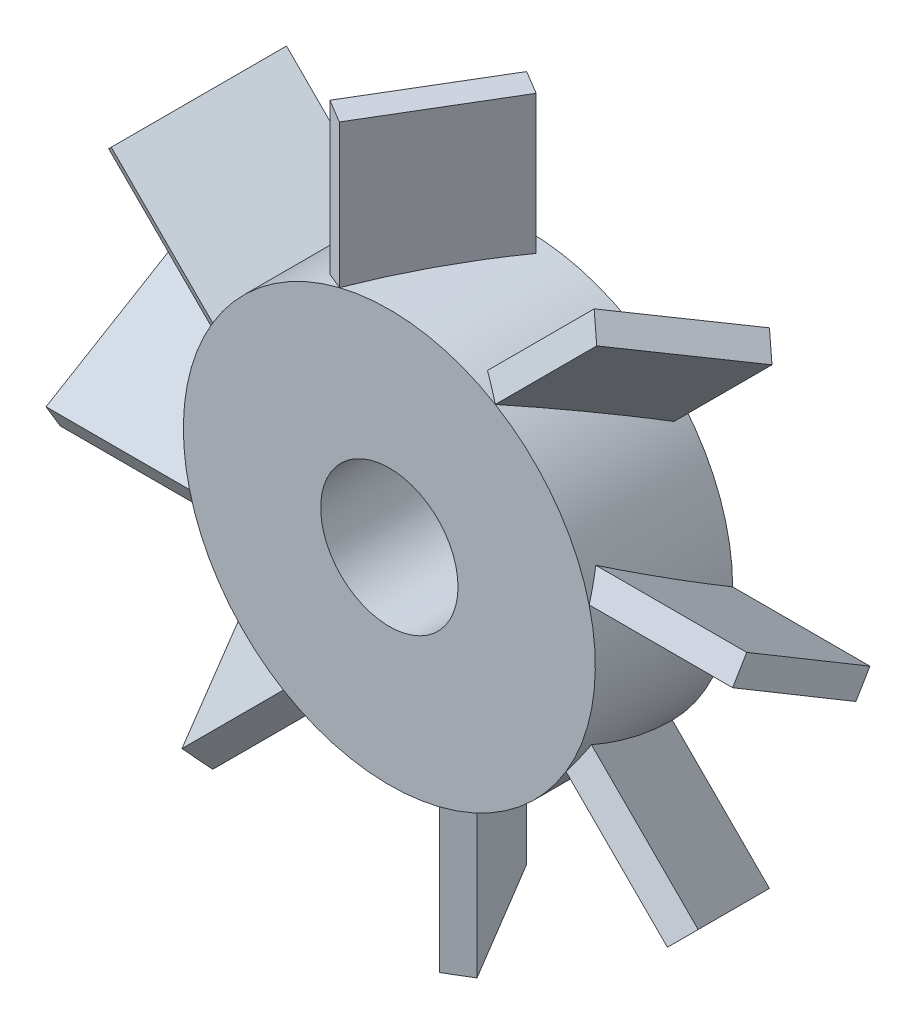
ISO-10303-21;
HEADER;
FILE_DESCRIPTION(('STEP AP214'),'2;1');
FILE_NAME('part.step','',(''),(''),'','','');
FILE_SCHEMA(('AUTOMOTIVE_DESIGN { 1 0 10303 214 1 1 1 1 }'));
ENDSEC;
DATA;
#1=APPLICATION_CONTEXT('core data for automotive mechanical design processes');
#2=APPLICATION_PROTOCOL_DEFINITION('international standard','automotive_design',2000,#1);
#3=PRODUCT_CONTEXT('',#1,'mechanical');
#4=PRODUCT('Part','Part','',(#3));
#5=PRODUCT_RELATED_PRODUCT_CATEGORY('part','',(#4));
#6=PRODUCT_DEFINITION_FORMATION('','',#4);
#7=PRODUCT_DEFINITION_CONTEXT('part definition',#1,'design');
#8=PRODUCT_DEFINITION('design','',#6,#7);
#9=PRODUCT_DEFINITION_SHAPE('','',#8);
#10=(LENGTH_UNIT() NAMED_UNIT(*) SI_UNIT(.MILLI.,.METRE.));
#11=(NAMED_UNIT(*) PLANE_ANGLE_UNIT() SI_UNIT($,.RADIAN.));
#12=(NAMED_UNIT(*) SI_UNIT($,.STERADIAN.) SOLID_ANGLE_UNIT());
#13=UNCERTAINTY_MEASURE_WITH_UNIT(LENGTH_MEASURE(1.E-05),#10,'distance_accuracy_value','');
#14=(GEOMETRIC_REPRESENTATION_CONTEXT(3) GLOBAL_UNCERTAINTY_ASSIGNED_CONTEXT((#13)) GLOBAL_UNIT_ASSIGNED_CONTEXT((#10,
#11,#12)) REPRESENTATION_CONTEXT('',''));
#15=CARTESIAN_POINT('',(0.,0.,0.));
#16=DIRECTION('',(0.,0.,1.));
#17=DIRECTION('',(1.,0.,0.));
#18=AXIS2_PLACEMENT_3D('',#15,#16,#17);
#19=CARTESIAN_POINT('',(0.,0.,5.));
#20=DIRECTION('',(0.,0.,-1.));
#21=DIRECTION('',(-1.,0.,0.));
#22=AXIS2_PLACEMENT_3D('',#19,#20,#21);
#23=CYLINDRICAL_SURFACE('',#22,7.5);
#24=CARTESIAN_POINT('',(0.,0.,0.));
#25=DIRECTION('',(0.607170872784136,-0.607170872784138,0.512530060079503));
#26=DIRECTION('',(0.362413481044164,-0.362413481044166,-0.858669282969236));
#27=AXIS2_PLACEMENT_3D('',#24,#25,#26);
#28=ELLIPSE('',#27,14.6332880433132,7.5);
#29=CARTESIAN_POINT('',(5.30330085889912,5.3033008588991,0.));
#30=VERTEX_POINT('',#29);
#31=CARTESIAN_POINT('',(3.05956077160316,6.84756072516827,4.4874699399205));
#32=VERTEX_POINT('',#31);
#33=EDGE_CURVE('E453',#30,#32,#28,.T.);
#34=ORIENTED_EDGE('',*,*,#33,.F.);
#35=CARTESIAN_POINT('',(0.,0.,0.));
#36=DIRECTION('',(0.,0.,1.));
#37=DIRECTION('',(1.,0.,0.));
#38=AXIS2_PLACEMENT_3D('',#35,#36,#37);
#39=CIRCLE('',#38,7.5);
#40=CARTESIAN_POINT('',(0.,7.5,0.));
#41=VERTEX_POINT('',#40);
#42=EDGE_CURVE('E527',#30,#41,#39,.T.);
#43=ORIENTED_EDGE('',*,*,#42,.T.);
#44=CARTESIAN_POINT('',(0.,0.,0.));
#45=DIRECTION('',(0.512530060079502,0.,-0.858669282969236));
#46=DIRECTION('',(-0.858669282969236,0.,-0.512530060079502));
#47=AXIS2_PLACEMENT_3D('',#44,#45,#46);
#48=ELLIPSE('',#47,8.73444543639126,7.5);
#49=CARTESIAN_POINT('',(0.858669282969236,7.4506836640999,0.512530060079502));
#50=VERTEX_POINT('',#49);
#51=EDGE_CURVE('E520',#41,#50,#48,.T.);
#52=ORIENTED_EDGE('',*,*,#51,.T.);
#53=CARTESIAN_POINT('',(0.,0.,1.95110507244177));
#54=DIRECTION('',(-0.858669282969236,0.,-0.512530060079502));
#55=DIRECTION('',(0.512530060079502,0.,-0.858669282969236));
#56=AXIS2_PLACEMENT_3D('',#53,#54,#55);
#57=ELLIPSE('',#56,14.6332880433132,7.5);
#58=CARTESIAN_POINT('',(-1.819851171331,7.27586020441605,5.));
#59=VERTEX_POINT('',#58);
#60=EDGE_CURVE('E522',#59,#50,#57,.T.);
#61=ORIENTED_EDGE('',*,*,#60,.F.);
#62=CARTESIAN_POINT('',(0.,0.,5.));
#63=DIRECTION('',(0.,0.,1.));
#64=DIRECTION('',(1.,0.,0.));
#65=AXIS2_PLACEMENT_3D('',#62,#63,#64);
#66=CIRCLE('',#65,7.5);
#67=CARTESIAN_POINT('',(3.85798098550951,6.43163919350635,5.));
#68=VERTEX_POINT('',#67);
#69=EDGE_CURVE('E38',#68,#59,#66,.T.);
#70=ORIENTED_EDGE('',*,*,#69,.F.);
#71=CARTESIAN_POINT('',(0.,0.,6.08624874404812));
#72=DIRECTION('',(0.362413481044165,-0.362413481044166,-0.858669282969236));
#73=DIRECTION('',(-0.607170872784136,0.607170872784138,-0.512530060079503));
#74=AXIS2_PLACEMENT_3D('',#71,#72,#73);
#75=ELLIPSE('',#74,8.73444543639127,7.5);
#76=EDGE_CURVE('E53',#32,#68,#75,.T.);
#77=ORIENTED_EDGE('',*,*,#76,.F.);
#78=EDGE_LOOP('',(#34,#43,#52,#61,#70,#77));
#79=FACE_BOUND('',#78,.T.);
#80=ADVANCED_FACE('F30',(#79),#23,.T.);
#81=CARTESIAN_POINT('',(7.5,0.,0.));
#82=VERTEX_POINT('',#81);
#83=EDGE_CURVE('E537',#82,#30,#39,.T.);
#84=ORIENTED_EDGE('',*,*,#83,.T.);
#85=CARTESIAN_POINT('',(0.,0.,0.));
#86=DIRECTION('',(0.362413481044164,-0.362413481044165,-0.858669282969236));
#87=DIRECTION('',(-0.607170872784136,0.607170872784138,-0.512530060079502));
#88=AXIS2_PLACEMENT_3D('',#85,#86,#87);
#89=ELLIPSE('',#88,8.73444543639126,7.5);
#90=CARTESIAN_POINT('',(5.87559981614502,4.66125807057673,0.512530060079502));
#91=VERTEX_POINT('',#90);
#92=EDGE_CURVE('E45',#30,#91,#89,.T.);
#93=ORIENTED_EDGE('',*,*,#92,.T.);
#94=CARTESIAN_POINT('',(0.,0.,1.95110507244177));
#95=DIRECTION('',(-0.607170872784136,0.607170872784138,-0.512530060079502));
#96=DIRECTION('',(0.362413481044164,-0.362413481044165,-0.858669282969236));
#97=AXIS2_PLACEMENT_3D('',#94,#95,#96);
#98=ELLIPSE('',#97,14.6332880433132,7.5);
#99=EDGE_CURVE('E491',#68,#91,#98,.T.);
#100=ORIENTED_EDGE('',*,*,#99,.F.);
#101=CARTESIAN_POINT('',(7.27586020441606,1.81985117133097,5.));
#102=VERTEX_POINT('',#101);
#103=EDGE_CURVE('E534',#102,#68,#66,.T.);
#104=ORIENTED_EDGE('',*,*,#103,.F.);
#105=CARTESIAN_POINT('',(0.,0.,6.08624874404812));
#106=DIRECTION('',(0.,-0.512530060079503,-0.858669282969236));
#107=DIRECTION('',(0.,0.858669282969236,-0.512530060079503));
#108=AXIS2_PLACEMENT_3D('',#105,#106,#107);
#109=ELLIPSE('',#108,8.73444543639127,7.5);
#110=CARTESIAN_POINT('',(7.0053927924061,2.67852045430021,4.4874699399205));
#111=VERTEX_POINT('',#110);
#112=EDGE_CURVE('E487',#111,#102,#109,.T.);
#113=ORIENTED_EDGE('',*,*,#112,.F.);
#114=CARTESIAN_POINT('',(0.,0.,0.));
#115=DIRECTION('',(0.,-0.858669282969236,0.512530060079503));
#116=DIRECTION('',(0.,-0.512530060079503,-0.858669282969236));
#117=AXIS2_PLACEMENT_3D('',#114,#115,#116);
#118=ELLIPSE('',#117,14.6332880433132,7.5);
#119=EDGE_CURVE('E446',#82,#111,#118,.T.);
#120=ORIENTED_EDGE('',*,*,#119,.F.);
#121=EDGE_LOOP('',(#84,#93,#100,#104,#113,#120));
#122=FACE_BOUND('',#121,.T.);
#123=ADVANCED_FACE('F604',(#122),#23,.T.);
#124=CARTESIAN_POINT('',(0.,0.,1.95110507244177));
#125=DIRECTION('',(0.60717087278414,0.607170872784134,-0.512530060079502));
#126=DIRECTION('',(-0.362413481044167,-0.362413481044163,-0.858669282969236));
#127=AXIS2_PLACEMENT_3D('',#124,#125,#126);
#128=ELLIPSE('',#127,14.6332880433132,7.5);
#129=CARTESIAN_POINT('',(6.43163919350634,-3.85798098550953,5.));
#130=VERTEX_POINT('',#129);
#131=CARTESIAN_POINT('',(4.66125807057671,-5.87559981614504,0.512530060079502));
#132=VERTEX_POINT('',#131);
#133=EDGE_CURVE('E477',#130,#132,#128,.T.);
#134=ORIENTED_EDGE('',*,*,#133,.F.);
#135=CARTESIAN_POINT('',(1.81985117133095,-7.27586020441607,5.));
#136=VERTEX_POINT('',#135);
#137=EDGE_CURVE('E585',#136,#130,#66,.T.);
#138=ORIENTED_EDGE('',*,*,#137,.F.);
#139=CARTESIAN_POINT('',(0.,0.,6.08624874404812));
#140=DIRECTION('',(-0.512530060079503,0.,-0.858669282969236));
#141=DIRECTION('',(0.858669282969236,0.,-0.512530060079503));
#142=AXIS2_PLACEMENT_3D('',#139,#140,#141);
#143=ELLIPSE('',#142,8.73444543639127,7.5);
#144=CARTESIAN_POINT('',(2.67852045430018,-7.00539279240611,4.4874699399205));
#145=VERTEX_POINT('',#144);
#146=EDGE_CURVE('E474',#145,#136,#143,.T.);
#147=ORIENTED_EDGE('',*,*,#146,.F.);
#148=CARTESIAN_POINT('',(0.,0.,0.));
#149=DIRECTION('',(-0.858669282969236,0.,0.512530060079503));
#150=DIRECTION('',(-0.512530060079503,0.,-0.858669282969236));
#151=AXIS2_PLACEMENT_3D('',#148,#149,#150);
#152=ELLIPSE('',#151,14.6332880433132,7.5);
#153=CARTESIAN_POINT('',(0.,-7.5,0.));
#154=VERTEX_POINT('',#153);
#155=EDGE_CURVE('E436',#154,#145,#152,.T.);
#156=ORIENTED_EDGE('',*,*,#155,.F.);
#157=CARTESIAN_POINT('',(5.30330085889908,-5.30330085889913,0.));
#158=VERTEX_POINT('',#157);
#159=EDGE_CURVE('E542',#154,#158,#39,.T.);
#160=ORIENTED_EDGE('',*,*,#159,.T.);
#161=CARTESIAN_POINT('',(0.,0.,0.));
#162=DIRECTION('',(-0.362413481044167,-0.362413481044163,-0.858669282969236));
#163=DIRECTION('',(0.60717087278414,0.607170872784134,-0.512530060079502));
#164=AXIS2_PLACEMENT_3D('',#161,#162,#163);
#165=ELLIPSE('',#164,8.73444543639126,7.5);
#166=EDGE_CURVE('E444',#158,#132,#165,.T.);
#167=ORIENTED_EDGE('',*,*,#166,.T.);
#168=EDGE_LOOP('',(#134,#138,#147,#156,#160,#167));
#169=FACE_BOUND('',#168,.T.);
#170=ADVANCED_FACE('F609',(#169),#23,.T.);
#171=EDGE_CURVE('E539',#158,#82,#39,.T.);
#172=ORIENTED_EDGE('',*,*,#171,.T.);
#173=CARTESIAN_POINT('',(0.,0.,0.));
#174=DIRECTION('',(0.,-0.512530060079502,-0.858669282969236));
#175=DIRECTION('',(0.,0.858669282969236,-0.512530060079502));
#176=AXIS2_PLACEMENT_3D('',#173,#174,#175);
#177=ELLIPSE('',#176,8.73444543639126,7.5);
#178=CARTESIAN_POINT('',(7.45068366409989,-0.858669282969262,0.512530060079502));
#179=VERTEX_POINT('',#178);
#180=EDGE_CURVE('E449',#82,#179,#177,.T.);
#181=ORIENTED_EDGE('',*,*,#180,.T.);
#182=CARTESIAN_POINT('',(0.,0.,1.95110507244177));
#183=DIRECTION('',(0.,0.858669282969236,-0.512530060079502));
#184=DIRECTION('',(0.,-0.512530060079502,-0.858669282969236));
#185=AXIS2_PLACEMENT_3D('',#182,#183,#184);
#186=ELLIPSE('',#185,14.6332880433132,7.5);
#187=EDGE_CURVE('E483',#102,#179,#186,.T.);
#188=ORIENTED_EDGE('',*,*,#187,.F.);
#189=EDGE_CURVE('E798',#130,#102,#66,.T.);
#190=ORIENTED_EDGE('',*,*,#189,.F.);
#191=CARTESIAN_POINT('',(0.,0.,6.08624874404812));
#192=DIRECTION('',(-0.362413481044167,-0.362413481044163,-0.858669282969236));
#193=DIRECTION('',(0.60717087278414,0.607170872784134,-0.512530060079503));
#194=AXIS2_PLACEMENT_3D('',#191,#192,#193);
#195=ELLIPSE('',#194,8.73444543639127,7.5);
#196=CARTESIAN_POINT('',(6.84756072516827,-3.05956077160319,4.4874699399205));
#197=VERTEX_POINT('',#196);
#198=EDGE_CURVE('E480',#197,#130,#195,.T.);
#199=ORIENTED_EDGE('',*,*,#198,.F.);
#200=CARTESIAN_POINT('',(0.,0.,0.));
#201=DIRECTION('',(-0.60717087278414,-0.607170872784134,0.512530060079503));
#202=DIRECTION('',(-0.362413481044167,-0.362413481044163,-0.858669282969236));
#203=AXIS2_PLACEMENT_3D('',#200,#201,#202);
#204=ELLIPSE('',#203,14.6332880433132,7.5);
#205=EDGE_CURVE('E441',#158,#197,#204,.T.);
#206=ORIENTED_EDGE('',*,*,#205,.F.);
#207=EDGE_LOOP('',(#172,#181,#188,#190,#199,#206));
#208=FACE_BOUND('',#207,.T.);
#209=ADVANCED_FACE('F797',(#208),#23,.T.);
#210=CARTESIAN_POINT('',(0.,0.,1.95110507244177));
#211=DIRECTION('',(0.858669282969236,0.,-0.512530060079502));
#212=DIRECTION('',(-0.512530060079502,0.,-0.858669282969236));
#213=AXIS2_PLACEMENT_3D('',#210,#211,#212);
#214=ELLIPSE('',#213,14.6332880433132,7.5);
#215=CARTESIAN_POINT('',(-0.858669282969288,-7.45068366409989,0.512530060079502));
#216=VERTEX_POINT('',#215);
#217=EDGE_CURVE('E471',#136,#216,#214,.T.);
#218=ORIENTED_EDGE('',*,*,#217,.F.);
#219=CARTESIAN_POINT('',(-3.85798098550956,-6.43163919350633,5.));
#220=VERTEX_POINT('',#219);
#221=EDGE_CURVE('E580',#220,#136,#66,.T.);
#222=ORIENTED_EDGE('',*,*,#221,.F.);
#223=CARTESIAN_POINT('',(0.,0.,6.08624874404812));
#224=DIRECTION('',(-0.362413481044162,0.362413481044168,-0.858669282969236));
#225=DIRECTION('',(0.607170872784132,-0.607170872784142,-0.512530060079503));
#226=AXIS2_PLACEMENT_3D('',#223,#224,#225);
#227=ELLIPSE('',#226,8.73444543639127,7.5);
#228=CARTESIAN_POINT('',(-3.05956077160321,-6.84756072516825,4.4874699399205));
#229=VERTEX_POINT('',#228);
#230=EDGE_CURVE('E468',#229,#220,#227,.T.);
#231=ORIENTED_EDGE('',*,*,#230,.F.);
#232=CARTESIAN_POINT('',(0.,0.,0.));
#233=DIRECTION('',(-0.607170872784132,0.607170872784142,0.512530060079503));
#234=DIRECTION('',(-0.362413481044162,0.362413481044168,-0.858669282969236));
#235=AXIS2_PLACEMENT_3D('',#232,#233,#234);
#236=ELLIPSE('',#235,14.6332880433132,7.5);
#237=CARTESIAN_POINT('',(-5.30330085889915,-5.30330085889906,0.));
#238=VERTEX_POINT('',#237);
#239=EDGE_CURVE('E431',#238,#229,#236,.T.);
#240=ORIENTED_EDGE('',*,*,#239,.F.);
#241=EDGE_CURVE('E547',#238,#154,#39,.T.);
#242=ORIENTED_EDGE('',*,*,#241,.T.);
#243=CARTESIAN_POINT('',(0.,0.,0.));
#244=DIRECTION('',(-0.512530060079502,0.,-0.858669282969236));
#245=DIRECTION('',(0.858669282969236,0.,-0.512530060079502));
#246=AXIS2_PLACEMENT_3D('',#243,#244,#245);
#247=ELLIPSE('',#246,8.73444543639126,7.5);
#248=EDGE_CURVE('E439',#154,#216,#247,.T.);
#249=ORIENTED_EDGE('',*,*,#248,.T.);
#250=EDGE_LOOP('',(#218,#222,#231,#240,#242,#249));
#251=FACE_BOUND('',#250,.T.);
#252=ADVANCED_FACE('F581',(#251),#23,.T.);
#253=CARTESIAN_POINT('',(0.,0.,1.95110507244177));
#254=DIRECTION('',(0.607170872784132,-0.607170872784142,-0.512530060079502));
#255=DIRECTION('',(-0.362413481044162,0.362413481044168,-0.858669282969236));
#256=AXIS2_PLACEMENT_3D('',#253,#254,#255);
#257=ELLIPSE('',#256,14.6332880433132,7.5);
#258=CARTESIAN_POINT('',(-5.87559981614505,-4.66125807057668,0.512530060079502));
#259=VERTEX_POINT('',#258);
#260=EDGE_CURVE('E465',#220,#259,#257,.T.);
#261=ORIENTED_EDGE('',*,*,#260,.F.);
#262=CARTESIAN_POINT('',(-7.27586020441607,-1.81985117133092,5.));
#263=VERTEX_POINT('',#262);
#264=EDGE_CURVE('E577',#263,#220,#66,.T.);
#265=ORIENTED_EDGE('',*,*,#264,.F.);
#266=CARTESIAN_POINT('',(0.,0.,6.08624874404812));
#267=DIRECTION('',(0.,0.512530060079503,-0.858669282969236));
#268=DIRECTION('',(0.,-0.858669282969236,-0.512530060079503));
#269=AXIS2_PLACEMENT_3D('',#266,#267,#268);
#270=ELLIPSE('',#269,8.73444543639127,7.5);
#271=CARTESIAN_POINT('',(-7.00539279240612,-2.67852045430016,4.4874699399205));
#272=VERTEX_POINT('',#271);
#273=EDGE_CURVE('E462',#272,#263,#270,.T.);
#274=ORIENTED_EDGE('',*,*,#273,.F.);
#275=CARTESIAN_POINT('',(0.,0.,0.));
#276=DIRECTION('',(0.,0.858669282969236,0.512530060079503));
#277=DIRECTION('',(0.,0.512530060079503,-0.858669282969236));
#278=AXIS2_PLACEMENT_3D('',#275,#276,#277);
#279=ELLIPSE('',#278,14.6332880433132,7.5);
#280=CARTESIAN_POINT('',(-7.5,0.,0.));
#281=VERTEX_POINT('',#280);
#282=EDGE_CURVE('E426',#281,#272,#279,.T.);
#283=ORIENTED_EDGE('',*,*,#282,.F.);
#284=EDGE_CURVE('E536',#281,#238,#39,.T.);
#285=ORIENTED_EDGE('',*,*,#284,.T.);
#286=CARTESIAN_POINT('',(0.,0.,0.));
#287=DIRECTION('',(-0.362413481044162,0.362413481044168,-0.858669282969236));
#288=DIRECTION('',(0.607170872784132,-0.607170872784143,-0.512530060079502));
#289=AXIS2_PLACEMENT_3D('',#286,#287,#288);
#290=ELLIPSE('',#289,8.73444543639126,7.5);
#291=EDGE_CURVE('E434',#238,#259,#290,.T.);
#292=ORIENTED_EDGE('',*,*,#291,.T.);
#293=EDGE_LOOP('',(#261,#265,#274,#283,#285,#292));
#294=FACE_BOUND('',#293,.T.);
#295=ADVANCED_FACE('F559',(#294),#23,.T.);
#296=CARTESIAN_POINT('',(0.,0.,1.95110507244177));
#297=DIRECTION('',(0.,-0.858669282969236,-0.512530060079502));
#298=DIRECTION('',(0.,0.512530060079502,-0.858669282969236));
#299=AXIS2_PLACEMENT_3D('',#296,#297,#298);
#300=ELLIPSE('',#299,14.6332880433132,7.5);
#301=CARTESIAN_POINT('',(-7.45068366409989,0.858669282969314,0.512530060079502));
#302=VERTEX_POINT('',#301);
#303=EDGE_CURVE('E459',#263,#302,#300,.T.);
#304=ORIENTED_EDGE('',*,*,#303,.F.);
#305=CARTESIAN_POINT('',(-6.43163919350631,3.85798098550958,5.));
#306=VERTEX_POINT('',#305);
#307=EDGE_CURVE('E37',#306,#263,#66,.T.);
#308=ORIENTED_EDGE('',*,*,#307,.F.);
#309=CARTESIAN_POINT('',(0.,0.,6.08624874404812));
#310=DIRECTION('',(0.36241348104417,0.362413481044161,-0.858669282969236));
#311=DIRECTION('',(-0.607170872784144,-0.60717087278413,-0.512530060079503));
#312=AXIS2_PLACEMENT_3D('',#309,#310,#311);
#313=ELLIPSE('',#312,8.73444543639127,7.5);
#314=CARTESIAN_POINT('',(-6.84756072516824,3.05956077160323,4.4874699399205));
#315=VERTEX_POINT('',#314);
#316=EDGE_CURVE('E456',#315,#306,#313,.T.);
#317=ORIENTED_EDGE('',*,*,#316,.F.);
#318=CARTESIAN_POINT('',(0.,0.,0.));
#319=DIRECTION('',(0.607170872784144,0.60717087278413,0.512530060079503));
#320=DIRECTION('',(0.362413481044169,0.36241348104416,-0.858669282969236));
#321=AXIS2_PLACEMENT_3D('',#318,#319,#320);
#322=ELLIPSE('',#321,14.6332880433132,7.5);
#323=CARTESIAN_POINT('',(-5.30330085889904,5.30330085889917,0.));
#324=VERTEX_POINT('',#323);
#325=EDGE_CURVE('E423',#324,#315,#322,.T.);
#326=ORIENTED_EDGE('',*,*,#325,.F.);
#327=EDGE_CURVE('E530',#324,#281,#39,.T.);
#328=ORIENTED_EDGE('',*,*,#327,.T.);
#329=CARTESIAN_POINT('',(0.,0.,0.));
#330=DIRECTION('',(0.,0.512530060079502,-0.858669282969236));
#331=DIRECTION('',(0.,-0.858669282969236,-0.512530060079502));
#332=AXIS2_PLACEMENT_3D('',#329,#330,#331);
#333=ELLIPSE('',#332,8.73444543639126,7.5);
#334=EDGE_CURVE('E429',#281,#302,#333,.T.);
#335=ORIENTED_EDGE('',*,*,#334,.T.);
#336=EDGE_LOOP('',(#304,#308,#317,#326,#328,#335));
#337=FACE_BOUND('',#336,.T.);
#338=ADVANCED_FACE('F611',(#337),#23,.T.);
#339=CARTESIAN_POINT('',(0.,0.,1.95110507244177));
#340=DIRECTION('',(-0.607170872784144,-0.60717087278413,-0.512530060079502));
#341=DIRECTION('',(0.362413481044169,0.36241348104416,-0.858669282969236));
#342=AXIS2_PLACEMENT_3D('',#339,#340,#341);
#343=ELLIPSE('',#342,14.6332880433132,7.5);
#344=CARTESIAN_POINT('',(-4.66125807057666,5.87559981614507,0.512530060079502));
#345=VERTEX_POINT('',#344);
#346=EDGE_CURVE('E250',#306,#345,#343,.T.);
#347=ORIENTED_EDGE('',*,*,#346,.F.);
#348=EDGE_CURVE('E11',#59,#306,#66,.T.);
#349=ORIENTED_EDGE('',*,*,#348,.F.);
#350=CARTESIAN_POINT('',(0.,0.,6.08624874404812));
#351=DIRECTION('',(0.512530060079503,0.,-0.858669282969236));
#352=DIRECTION('',(-0.858669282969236,0.,-0.512530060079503));
#353=AXIS2_PLACEMENT_3D('',#350,#351,#352);
#354=ELLIPSE('',#353,8.73444543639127,7.5);
#355=CARTESIAN_POINT('',(-2.67852045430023,7.0053927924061,4.4874699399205));
#356=VERTEX_POINT('',#355);
#357=EDGE_CURVE('E525',#356,#59,#354,.T.);
#358=ORIENTED_EDGE('',*,*,#357,.F.);
#359=CARTESIAN_POINT('',(0.,0.,0.));
#360=DIRECTION('',(0.858669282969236,0.,0.512530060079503));
#361=DIRECTION('',(0.512530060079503,0.,-0.858669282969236));
#362=AXIS2_PLACEMENT_3D('',#359,#360,#361);
#363=ELLIPSE('',#362,14.6332880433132,7.5);
#364=EDGE_CURVE('E517',#41,#356,#363,.T.);
#365=ORIENTED_EDGE('',*,*,#364,.F.);
#366=EDGE_CURVE('E528',#41,#324,#39,.T.);
#367=ORIENTED_EDGE('',*,*,#366,.T.);
#368=CARTESIAN_POINT('',(0.,0.,0.));
#369=DIRECTION('',(0.362413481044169,0.36241348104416,-0.858669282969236));
#370=DIRECTION('',(-0.607170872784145,-0.60717087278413,-0.512530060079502));
#371=AXIS2_PLACEMENT_3D('',#368,#369,#370);
#372=ELLIPSE('',#371,8.73444543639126,7.5);
#373=EDGE_CURVE('E451',#324,#345,#372,.T.);
#374=ORIENTED_EDGE('',*,*,#373,.T.);
#375=EDGE_LOOP('',(#347,#349,#358,#365,#367,#374));
#376=FACE_BOUND('',#375,.T.);
#377=ADVANCED_FACE('F605',(#376),#23,.T.);
#378=CARTESIAN_POINT('',(0.,0.,5.));
#379=DIRECTION('',(0.,0.,1.));
#380=DIRECTION('',(1.,0.,0.));
#381=AXIS2_PLACEMENT_3D('',#378,#379,#380);
#382=PLANE('',#381);
#383=CARTESIAN_POINT('',(0.,0.,5.));
#384=DIRECTION('',(0.,0.,1.));
#385=DIRECTION('',(1.,0.,0.));
#386=AXIS2_PLACEMENT_3D('',#383,#384,#385);
#387=CIRCLE('',#386,2.5);
#388=CARTESIAN_POINT('',(2.5,0.,5.));
#389=VERTEX_POINT('',#388);
#390=EDGE_CURVE('E688',#389,#389,#387,.T.);
#391=ORIENTED_EDGE('',*,*,#390,.F.);
#392=EDGE_LOOP('',(#391));
#393=FACE_BOUND('',#392,.T.);
#394=ORIENTED_EDGE('',*,*,#103,.T.);
#395=ORIENTED_EDGE('',*,*,#69,.T.);
#396=ORIENTED_EDGE('',*,*,#348,.T.);
#397=ORIENTED_EDGE('',*,*,#307,.T.);
#398=ORIENTED_EDGE('',*,*,#264,.T.);
#399=ORIENTED_EDGE('',*,*,#221,.T.);
#400=ORIENTED_EDGE('',*,*,#137,.T.);
#401=ORIENTED_EDGE('',*,*,#189,.T.);
#402=EDGE_LOOP('',(#394,#395,#396,#397,#398,#399,#400,#401));
#403=FACE_BOUND('',#402,.T.);
#404=ADVANCED_FACE('F586',(#393,#403),#382,.T.);
#405=CARTESIAN_POINT('',(0.,0.,0.));
#406=DIRECTION('',(0.,0.,1.));
#407=DIRECTION('',(1.,0.,0.));
#408=AXIS2_PLACEMENT_3D('',#405,#406,#407);
#409=PLANE('',#408);
#410=CARTESIAN_POINT('',(0.,0.,0.));
#411=DIRECTION('',(0.,0.,1.));
#412=DIRECTION('',(1.,0.,0.));
#413=AXIS2_PLACEMENT_3D('',#410,#411,#412);
#414=CIRCLE('',#413,2.5);
#415=CARTESIAN_POINT('',(2.5,0.,0.));
#416=VERTEX_POINT('',#415);
#417=EDGE_CURVE('E264',#416,#416,#414,.T.);
#418=ORIENTED_EDGE('',*,*,#417,.T.);
#419=EDGE_LOOP('',(#418));
#420=FACE_BOUND('',#419,.T.);
#421=ORIENTED_EDGE('',*,*,#42,.F.);
#422=ORIENTED_EDGE('',*,*,#83,.F.);
#423=ORIENTED_EDGE('',*,*,#171,.F.);
#424=ORIENTED_EDGE('',*,*,#159,.F.);
#425=ORIENTED_EDGE('',*,*,#241,.F.);
#426=ORIENTED_EDGE('',*,*,#284,.F.);
#427=ORIENTED_EDGE('',*,*,#327,.F.);
#428=ORIENTED_EDGE('',*,*,#366,.F.);
#429=EDGE_LOOP('',(#421,#422,#423,#424,#425,#426,#427,#428));
#430=FACE_BOUND('',#429,.T.);
#431=ADVANCED_FACE('F616',(#420,#430),#409,.F.);
#432=CARTESIAN_POINT('',(-2.67852045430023,12.5,4.4874699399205));
#433=DIRECTION('',(0.512530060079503,0.,-0.858669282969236));
#434=DIRECTION('',(-0.858669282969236,0.,-0.512530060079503));
#435=AXIS2_PLACEMENT_3D('',#432,#433,#434);
#436=PLANE('',#435);
#437=DIRECTION('',(0.,-1.,0.));
#438=VECTOR('',#437,1.);
#439=CARTESIAN_POINT('',(-2.67852045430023,12.5,4.4874699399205));
#440=LINE('',#439,#438);
#441=CARTESIAN_POINT('',(-2.67852045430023,12.5,4.4874699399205));
#442=VERTEX_POINT('',#441);
#443=EDGE_CURVE('E511',#442,#356,#440,.T.);
#444=ORIENTED_EDGE('',*,*,#443,.T.);
#445=ORIENTED_EDGE('',*,*,#357,.T.);
#446=DIRECTION('',(0.,-1.,0.));
#447=VECTOR('',#446,1.);
#448=CARTESIAN_POINT('',(-1.819851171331,12.5,5.));
#449=LINE('',#448,#447);
#450=CARTESIAN_POINT('',(-1.819851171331,12.5,5.));
#451=VERTEX_POINT('',#450);
#452=EDGE_CURVE('E508',#451,#59,#449,.T.);
#453=ORIENTED_EDGE('',*,*,#452,.F.);
#454=DIRECTION('',(0.858669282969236,0.,0.512530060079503));
#455=VECTOR('',#454,1.);
#456=CARTESIAN_POINT('',(-2.67852045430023,12.5,4.4874699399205));
#457=LINE('',#456,#455);
#458=EDGE_CURVE('E499',#442,#451,#457,.T.);
#459=ORIENTED_EDGE('',*,*,#458,.F.);
#460=EDGE_LOOP('',(#444,#445,#453,#459));
#461=FACE_BOUND('',#460,.T.);
#462=ADVANCED_FACE('F675',(#461),#436,.F.);
#463=CARTESIAN_POINT('',(-1.819851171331,12.5,5.));
#464=DIRECTION('',(-0.858669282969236,0.,-0.512530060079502));
#465=DIRECTION('',(-0.512530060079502,0.,0.858669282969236));
#466=AXIS2_PLACEMENT_3D('',#463,#464,#465);
#467=PLANE('',#466);
#468=ORIENTED_EDGE('',*,*,#452,.T.);
#469=ORIENTED_EDGE('',*,*,#60,.T.);
#470=DIRECTION('',(0.,-1.,0.));
#471=VECTOR('',#470,1.);
#472=CARTESIAN_POINT('',(0.858669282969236,12.5,0.512530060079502));
#473=LINE('',#472,#471);
#474=CARTESIAN_POINT('',(0.858669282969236,12.5,0.512530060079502));
#475=VERTEX_POINT('',#474);
#476=EDGE_CURVE('E505',#475,#50,#473,.T.);
#477=ORIENTED_EDGE('',*,*,#476,.F.);
#478=DIRECTION('',(0.512530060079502,0.,-0.858669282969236));
#479=VECTOR('',#478,1.);
#480=CARTESIAN_POINT('',(-1.819851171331,12.5,5.));
#481=LINE('',#480,#479);
#482=EDGE_CURVE('E496',#451,#475,#481,.T.);
#483=ORIENTED_EDGE('',*,*,#482,.F.);
#484=EDGE_LOOP('',(#468,#469,#477,#483));
#485=FACE_BOUND('',#484,.T.);
#486=ADVANCED_FACE('F638',(#485),#467,.F.);
#487=CARTESIAN_POINT('',(0.,12.5,0.));
#488=DIRECTION('',(0.512530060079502,0.,-0.858669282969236));
#489=DIRECTION('',(-0.858669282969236,0.,-0.512530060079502));
#490=AXIS2_PLACEMENT_3D('',#487,#488,#489);
#491=PLANE('',#490);
#492=ORIENTED_EDGE('',*,*,#51,.F.);
#493=DIRECTION('',(0.,-1.,0.));
#494=VECTOR('',#493,1.);
#495=CARTESIAN_POINT('',(0.,12.5,0.));
#496=LINE('',#495,#494);
#497=CARTESIAN_POINT('',(0.,12.5,0.));
#498=VERTEX_POINT('',#497);
#499=EDGE_CURVE('E514',#498,#41,#496,.T.);
#500=ORIENTED_EDGE('',*,*,#499,.F.);
#501=DIRECTION('',(0.858669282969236,0.,0.512530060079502));
#502=VECTOR('',#501,1.);
#503=CARTESIAN_POINT('',(0.,12.5,0.));
#504=LINE('',#503,#502);
#505=EDGE_CURVE('E493',#498,#475,#504,.T.);
#506=ORIENTED_EDGE('',*,*,#505,.T.);
#507=ORIENTED_EDGE('',*,*,#476,.T.);
#508=EDGE_LOOP('',(#492,#500,#506,#507));
#509=FACE_BOUND('',#508,.T.);
#510=ADVANCED_FACE('F628',(#509),#491,.T.);
#511=CARTESIAN_POINT('',(0.,12.5,0.));
#512=DIRECTION('',(0.858669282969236,0.,0.512530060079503));
#513=DIRECTION('',(0.512530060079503,0.,-0.858669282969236));
#514=AXIS2_PLACEMENT_3D('',#511,#512,#513);
#515=PLANE('',#514);
#516=ORIENTED_EDGE('',*,*,#499,.T.);
#517=ORIENTED_EDGE('',*,*,#364,.T.);
#518=ORIENTED_EDGE('',*,*,#443,.F.);
#519=DIRECTION('',(-0.512530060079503,0.,0.858669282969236));
#520=VECTOR('',#519,1.);
#521=CARTESIAN_POINT('',(0.,12.5,0.));
#522=LINE('',#521,#520);
#523=EDGE_CURVE('E502',#498,#442,#522,.T.);
#524=ORIENTED_EDGE('',*,*,#523,.F.);
#525=EDGE_LOOP('',(#516,#517,#518,#524));
#526=FACE_BOUND('',#525,.T.);
#527=ADVANCED_FACE('F632',(#526),#515,.F.);
#528=CARTESIAN_POINT('',(0.858669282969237,12.5,0.512530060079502));
#529=DIRECTION('',(0.,1.,0.));
#530=DIRECTION('',(0.,0.,1.));
#531=AXIS2_PLACEMENT_3D('',#528,#529,#530);
#532=PLANE('',#531);
#533=ORIENTED_EDGE('',*,*,#505,.F.);
#534=ORIENTED_EDGE('',*,*,#523,.T.);
#535=ORIENTED_EDGE('',*,*,#458,.T.);
#536=ORIENTED_EDGE('',*,*,#482,.T.);
#537=EDGE_LOOP('',(#533,#534,#535,#536));
#538=FACE_BOUND('',#537,.T.);
#539=ADVANCED_FACE('F635',(#538),#532,.T.);
#540=CARTESIAN_POINT('',(-8.23166389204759,9.44600563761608,0.512530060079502));
#541=DIRECTION('',(-0.707106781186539,0.707106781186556,0.));
#542=DIRECTION('',(0.,0.,1.));
#543=AXIS2_PLACEMENT_3D('',#540,#541,#542);
#544=PLANE('',#543);
#545=DIRECTION('',(0.607170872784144,0.60717087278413,0.512530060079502));
#546=VECTOR('',#545,1.);
#547=CARTESIAN_POINT('',(-8.83883476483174,8.83883476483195,0.));
#548=LINE('',#547,#546);
#549=CARTESIAN_POINT('',(-8.83883476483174,8.83883476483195,0.));
#550=VERTEX_POINT('',#549);
#551=CARTESIAN_POINT('',(-8.23166389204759,9.44600563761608,0.512530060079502));
#552=VERTEX_POINT('',#551);
#553=EDGE_CURVE('E257',#550,#552,#548,.T.);
#554=ORIENTED_EDGE('',*,*,#553,.F.);
#555=DIRECTION('',(-0.362413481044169,-0.36241348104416,0.858669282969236));
#556=VECTOR('',#555,1.);
#557=CARTESIAN_POINT('',(-8.83883476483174,8.83883476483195,0.));
#558=LINE('',#557,#556);
#559=CARTESIAN_POINT('',(-10.7328347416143,6.94483478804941,4.4874699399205));
#560=VERTEX_POINT('',#559);
#561=EDGE_CURVE('E254',#550,#560,#558,.T.);
#562=ORIENTED_EDGE('',*,*,#561,.T.);
#563=DIRECTION('',(0.607170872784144,0.60717087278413,0.512530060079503));
#564=VECTOR('',#563,1.);
#565=CARTESIAN_POINT('',(-10.7328347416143,6.94483478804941,4.4874699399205));
#566=LINE('',#565,#564);
#567=CARTESIAN_POINT('',(-10.1256638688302,7.55200566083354,5.));
#568=VERTEX_POINT('',#567);
#569=EDGE_CURVE('E268',#560,#568,#566,.T.);
#570=ORIENTED_EDGE('',*,*,#569,.T.);
#571=DIRECTION('',(0.362413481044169,0.36241348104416,-0.858669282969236));
#572=VECTOR('',#571,1.);
#573=CARTESIAN_POINT('',(-10.1256638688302,7.55200566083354,5.));
#574=LINE('',#573,#572);
#575=EDGE_CURVE('E248',#568,#552,#574,.T.);
#576=ORIENTED_EDGE('',*,*,#575,.T.);
#577=EDGE_LOOP('',(#554,#562,#570,#576));
#578=FACE_BOUND('',#577,.T.);
#579=ADVANCED_FACE('F266',(#578),#544,.T.);
#580=CARTESIAN_POINT('',(-8.83883476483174,8.83883476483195,0.));
#581=DIRECTION('',(0.607170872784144,0.60717087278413,0.512530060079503));
#582=DIRECTION('',(-0.707106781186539,0.707106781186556,0.));
#583=AXIS2_PLACEMENT_3D('',#580,#581,#582);
#584=PLANE('',#583);
#585=DIRECTION('',(0.707106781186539,-0.707106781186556,0.));
#586=VECTOR('',#585,1.);
#587=CARTESIAN_POINT('',(-8.83883476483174,8.83883476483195,0.));
#588=LINE('',#587,#586);
#589=EDGE_CURVE('E260',#550,#324,#588,.T.);
#590=ORIENTED_EDGE('',*,*,#589,.T.);
#591=ORIENTED_EDGE('',*,*,#325,.T.);
#592=DIRECTION('',(0.707106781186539,-0.707106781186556,0.));
#593=VECTOR('',#592,1.);
#594=CARTESIAN_POINT('',(-10.7328347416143,6.94483478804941,4.4874699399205));
#595=LINE('',#594,#593);
#596=EDGE_CURVE('E275',#560,#315,#595,.T.);
#597=ORIENTED_EDGE('',*,*,#596,.F.);
#598=ORIENTED_EDGE('',*,*,#561,.F.);
#599=EDGE_LOOP('',(#590,#591,#597,#598));
#600=FACE_BOUND('',#599,.T.);
#601=ADVANCED_FACE('F624',(#600),#584,.F.);
#602=CARTESIAN_POINT('',(-10.7328347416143,6.94483478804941,4.4874699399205));
#603=DIRECTION('',(0.36241348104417,0.362413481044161,-0.858669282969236));
#604=DIRECTION('',(-0.921301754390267,0.,-0.38884839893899));
#605=AXIS2_PLACEMENT_3D('',#602,#603,#604);
#606=PLANE('',#605);
#607=ORIENTED_EDGE('',*,*,#596,.T.);
#608=ORIENTED_EDGE('',*,*,#316,.T.);
#609=DIRECTION('',(0.707106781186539,-0.707106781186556,0.));
#610=VECTOR('',#609,1.);
#611=CARTESIAN_POINT('',(-10.1256638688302,7.55200566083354,5.));
#612=LINE('',#611,#610);
#613=EDGE_CURVE('E253',#568,#306,#612,.T.);
#614=ORIENTED_EDGE('',*,*,#613,.F.);
#615=ORIENTED_EDGE('',*,*,#569,.F.);
#616=EDGE_LOOP('',(#607,#608,#614,#615));
#617=FACE_BOUND('',#616,.T.);
#618=ADVANCED_FACE('F622',(#617),#606,.F.);
#619=CARTESIAN_POINT('',(-8.83883476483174,8.83883476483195,0.));
#620=DIRECTION('',(0.362413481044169,0.36241348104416,-0.858669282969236));
#621=DIRECTION('',(-0.921301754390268,0.,-0.388848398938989));
#622=AXIS2_PLACEMENT_3D('',#619,#620,#621);
#623=PLANE('',#622);
#624=ORIENTED_EDGE('',*,*,#373,.F.);
#625=ORIENTED_EDGE('',*,*,#589,.F.);
#626=ORIENTED_EDGE('',*,*,#553,.T.);
#627=DIRECTION('',(0.707106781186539,-0.707106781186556,0.));
#628=VECTOR('',#627,1.);
#629=CARTESIAN_POINT('',(-8.23166389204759,9.44600563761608,0.512530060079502));
#630=LINE('',#629,#628);
#631=EDGE_CURVE('E243',#552,#345,#630,.T.);
#632=ORIENTED_EDGE('',*,*,#631,.T.);
#633=EDGE_LOOP('',(#624,#625,#626,#632));
#634=FACE_BOUND('',#633,.T.);
#635=ADVANCED_FACE('F258',(#634),#623,.T.);
#636=CARTESIAN_POINT('',(-10.1256638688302,7.55200566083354,5.));
#637=DIRECTION('',(-0.607170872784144,-0.60717087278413,-0.512530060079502));
#638=DIRECTION('',(0.707106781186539,-0.707106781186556,0.));
#639=AXIS2_PLACEMENT_3D('',#636,#637,#638);
#640=PLANE('',#639);
#641=ORIENTED_EDGE('',*,*,#613,.T.);
#642=ORIENTED_EDGE('',*,*,#346,.T.);
#643=ORIENTED_EDGE('',*,*,#631,.F.);
#644=ORIENTED_EDGE('',*,*,#575,.F.);
#645=EDGE_LOOP('',(#641,#642,#643,#644));
#646=FACE_BOUND('',#645,.T.);
#647=ADVANCED_FACE('F246',(#646),#640,.F.);
#648=CARTESIAN_POINT('',(-12.5,0.858669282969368,0.512530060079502));
#649=DIRECTION('',(-1.,0.,0.));
#650=DIRECTION('',(0.,0.,1.));
#651=AXIS2_PLACEMENT_3D('',#648,#649,#650);
#652=PLANE('',#651);
#653=DIRECTION('',(0.,0.858669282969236,0.512530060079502));
#654=VECTOR('',#653,1.);
#655=CARTESIAN_POINT('',(-12.5,1.30930626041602E-13,0.));
#656=LINE('',#655,#654);
#657=CARTESIAN_POINT('',(-12.5,1.30930626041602E-13,0.));
#658=VERTEX_POINT('',#657);
#659=CARTESIAN_POINT('',(-12.5,0.858669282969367,0.512530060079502));
#660=VERTEX_POINT('',#659);
#661=EDGE_CURVE('E279',#658,#660,#656,.T.);
#662=ORIENTED_EDGE('',*,*,#661,.F.);
#663=DIRECTION('',(0.,-0.512530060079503,0.858669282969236));
#664=VECTOR('',#663,1.);
#665=CARTESIAN_POINT('',(-12.5,1.30930626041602E-13,0.));
#666=LINE('',#665,#664);
#667=CARTESIAN_POINT('',(-12.5,-2.6785204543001,4.4874699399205));
#668=VERTEX_POINT('',#667);
#669=EDGE_CURVE('E288',#658,#668,#666,.T.);
#670=ORIENTED_EDGE('',*,*,#669,.T.);
#671=DIRECTION('',(0.,0.858669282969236,0.512530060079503));
#672=VECTOR('',#671,1.);
#673=CARTESIAN_POINT('',(-12.5,-2.6785204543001,4.4874699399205));
#674=LINE('',#673,#672);
#675=CARTESIAN_POINT('',(-12.5,-1.81985117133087,5.));
#676=VERTEX_POINT('',#675);
#677=EDGE_CURVE('E285',#668,#676,#674,.T.);
#678=ORIENTED_EDGE('',*,*,#677,.T.);
#679=DIRECTION('',(0.,0.512530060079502,-0.858669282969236));
#680=VECTOR('',#679,1.);
#681=CARTESIAN_POINT('',(-12.5,-1.81985117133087,5.));
#682=LINE('',#681,#680);
#683=EDGE_CURVE('E282',#676,#660,#682,.T.);
#684=ORIENTED_EDGE('',*,*,#683,.T.);
#685=EDGE_LOOP('',(#662,#670,#678,#684));
#686=FACE_BOUND('',#685,.T.);
#687=ADVANCED_FACE('F706',(#686),#652,.T.);
#688=CARTESIAN_POINT('',(-12.5,-1.81985117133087,5.));
#689=DIRECTION('',(0.,-0.858669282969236,-0.512530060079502));
#690=DIRECTION('',(0.,0.512530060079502,-0.858669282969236));
#691=AXIS2_PLACEMENT_3D('',#688,#689,#690);
#692=PLANE('',#691);
#693=DIRECTION('',(1.,0.,0.));
#694=VECTOR('',#693,1.);
#695=CARTESIAN_POINT('',(-12.5,-1.81985117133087,5.));
#696=LINE('',#695,#694);
#697=EDGE_CURVE('E294',#676,#263,#696,.T.);
#698=ORIENTED_EDGE('',*,*,#697,.T.);
#699=ORIENTED_EDGE('',*,*,#303,.T.);
#700=DIRECTION('',(1.,0.,0.));
#701=VECTOR('',#700,1.);
#702=CARTESIAN_POINT('',(-12.5,0.858669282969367,0.512530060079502));
#703=LINE('',#702,#701);
#704=EDGE_CURVE('E291',#660,#302,#703,.T.);
#705=ORIENTED_EDGE('',*,*,#704,.F.);
#706=ORIENTED_EDGE('',*,*,#683,.F.);
#707=EDGE_LOOP('',(#698,#699,#705,#706));
#708=FACE_BOUND('',#707,.T.);
#709=ADVANCED_FACE('F713',(#708),#692,.F.);
#710=CARTESIAN_POINT('',(-12.5,1.30930626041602E-13,0.));
#711=DIRECTION('',(0.,0.858669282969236,0.512530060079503));
#712=DIRECTION('',(0.,-0.512530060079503,0.858669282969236));
#713=AXIS2_PLACEMENT_3D('',#710,#711,#712);
#714=PLANE('',#713);
#715=DIRECTION('',(1.,0.,0.));
#716=VECTOR('',#715,1.);
#717=CARTESIAN_POINT('',(-12.5,1.30930626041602E-13,0.));
#718=LINE('',#717,#716);
#719=EDGE_CURVE('E300',#658,#281,#718,.T.);
#720=ORIENTED_EDGE('',*,*,#719,.T.);
#721=ORIENTED_EDGE('',*,*,#282,.T.);
#722=DIRECTION('',(1.,0.,0.));
#723=VECTOR('',#722,1.);
#724=CARTESIAN_POINT('',(-12.5,-2.6785204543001,4.4874699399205));
#725=LINE('',#724,#723);
#726=EDGE_CURVE('E297',#668,#272,#725,.T.);
#727=ORIENTED_EDGE('',*,*,#726,.F.);
#728=ORIENTED_EDGE('',*,*,#669,.F.);
#729=EDGE_LOOP('',(#720,#721,#727,#728));
#730=FACE_BOUND('',#729,.T.);
#731=ADVANCED_FACE('F719',(#730),#714,.F.);
#732=CARTESIAN_POINT('',(-12.5,1.30930626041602E-13,0.));
#733=DIRECTION('',(0.,0.512530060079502,-0.858669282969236));
#734=DIRECTION('',(0.,0.858669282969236,0.512530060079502));
#735=AXIS2_PLACEMENT_3D('',#732,#733,#734);
#736=PLANE('',#735);
#737=ORIENTED_EDGE('',*,*,#334,.F.);
#738=ORIENTED_EDGE('',*,*,#719,.F.);
#739=ORIENTED_EDGE('',*,*,#661,.T.);
#740=ORIENTED_EDGE('',*,*,#704,.T.);
#741=EDGE_LOOP('',(#737,#738,#739,#740));
#742=FACE_BOUND('',#741,.T.);
#743=ADVANCED_FACE('F715',(#742),#736,.T.);
#744=CARTESIAN_POINT('',(-12.5,-2.6785204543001,4.4874699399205));
#745=DIRECTION('',(0.,0.512530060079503,-0.858669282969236));
#746=DIRECTION('',(0.,0.858669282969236,0.512530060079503));
#747=AXIS2_PLACEMENT_3D('',#744,#745,#746);
#748=PLANE('',#747);
#749=ORIENTED_EDGE('',*,*,#726,.T.);
#750=ORIENTED_EDGE('',*,*,#273,.T.);
#751=ORIENTED_EDGE('',*,*,#697,.F.);
#752=ORIENTED_EDGE('',*,*,#677,.F.);
#753=EDGE_LOOP('',(#749,#750,#751,#752));
#754=FACE_BOUND('',#753,.T.);
#755=ADVANCED_FACE('F718',(#754),#748,.F.);
#756=CARTESIAN_POINT('',(-9.44600563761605,-8.23166389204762,0.512530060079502));
#757=DIRECTION('',(-0.707106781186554,-0.707106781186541,0.));
#758=DIRECTION('',(0.,0.,1.));
#759=AXIS2_PLACEMENT_3D('',#756,#757,#758);
#760=PLANE('',#759);
#761=DIRECTION('',(-0.607170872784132,0.607170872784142,0.512530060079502));
#762=VECTOR('',#761,1.);
#763=CARTESIAN_POINT('',(-8.83883476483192,-8.83883476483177,0.));
#764=LINE('',#763,#762);
#765=CARTESIAN_POINT('',(-8.83883476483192,-8.83883476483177,0.));
#766=VERTEX_POINT('',#765);
#767=CARTESIAN_POINT('',(-9.44600563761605,-8.23166389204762,0.512530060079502));
#768=VERTEX_POINT('',#767);
#769=EDGE_CURVE('E303',#766,#768,#764,.T.);
#770=ORIENTED_EDGE('',*,*,#769,.F.);
#771=DIRECTION('',(0.362413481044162,-0.362413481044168,0.858669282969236));
#772=VECTOR('',#771,1.);
#773=CARTESIAN_POINT('',(-8.83883476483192,-8.83883476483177,0.));
#774=LINE('',#773,#772);
#775=CARTESIAN_POINT('',(-6.94483478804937,-10.7328347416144,4.4874699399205));
#776=VERTEX_POINT('',#775);
#777=EDGE_CURVE('E312',#766,#776,#774,.T.);
#778=ORIENTED_EDGE('',*,*,#777,.T.);
#779=DIRECTION('',(-0.607170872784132,0.607170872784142,0.512530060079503));
#780=VECTOR('',#779,1.);
#781=CARTESIAN_POINT('',(-6.94483478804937,-10.7328347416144,4.4874699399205));
#782=LINE('',#781,#780);
#783=CARTESIAN_POINT('',(-7.5520056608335,-10.1256638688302,5.));
#784=VERTEX_POINT('',#783);
#785=EDGE_CURVE('E309',#776,#784,#782,.T.);
#786=ORIENTED_EDGE('',*,*,#785,.T.);
#787=DIRECTION('',(-0.362413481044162,0.362413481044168,-0.858669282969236));
#788=VECTOR('',#787,1.);
#789=CARTESIAN_POINT('',(-7.5520056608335,-10.1256638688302,5.));
#790=LINE('',#789,#788);
#791=EDGE_CURVE('E306',#784,#768,#790,.T.);
#792=ORIENTED_EDGE('',*,*,#791,.T.);
#793=EDGE_LOOP('',(#770,#778,#786,#792));
#794=FACE_BOUND('',#793,.T.);
#795=ADVANCED_FACE('F570',(#794),#760,.T.);
#796=CARTESIAN_POINT('',(-7.5520056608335,-10.1256638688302,5.));
#797=DIRECTION('',(0.607170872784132,-0.607170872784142,-0.512530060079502));
#798=DIRECTION('',(0.707106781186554,0.707106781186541,0.));
#799=AXIS2_PLACEMENT_3D('',#796,#797,#798);
#800=PLANE('',#799);
#801=DIRECTION('',(0.707106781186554,0.707106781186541,0.));
#802=VECTOR('',#801,1.);
#803=CARTESIAN_POINT('',(-7.5520056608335,-10.1256638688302,5.));
#804=LINE('',#803,#802);
#805=EDGE_CURVE('E318',#784,#220,#804,.T.);
#806=ORIENTED_EDGE('',*,*,#805,.T.);
#807=ORIENTED_EDGE('',*,*,#260,.T.);
#808=DIRECTION('',(0.707106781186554,0.707106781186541,0.));
#809=VECTOR('',#808,1.);
#810=CARTESIAN_POINT('',(-9.44600563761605,-8.23166389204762,0.512530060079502));
#811=LINE('',#810,#809);
#812=EDGE_CURVE('E315',#768,#259,#811,.T.);
#813=ORIENTED_EDGE('',*,*,#812,.F.);
#814=ORIENTED_EDGE('',*,*,#791,.F.);
#815=EDGE_LOOP('',(#806,#807,#813,#814));
#816=FACE_BOUND('',#815,.T.);
#817=ADVANCED_FACE('F573',(#816),#800,.F.);
#818=CARTESIAN_POINT('',(-8.83883476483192,-8.83883476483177,0.));
#819=DIRECTION('',(-0.607170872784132,0.607170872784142,0.512530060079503));
#820=DIRECTION('',(-0.707106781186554,-0.707106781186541,0.));
#821=AXIS2_PLACEMENT_3D('',#818,#819,#820);
#822=PLANE('',#821);
#823=DIRECTION('',(0.707106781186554,0.707106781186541,0.));
#824=VECTOR('',#823,1.);
#825=CARTESIAN_POINT('',(-8.83883476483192,-8.83883476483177,0.));
#826=LINE('',#825,#824);
#827=EDGE_CURVE('E324',#766,#238,#826,.T.);
#828=ORIENTED_EDGE('',*,*,#827,.T.);
#829=ORIENTED_EDGE('',*,*,#239,.T.);
#830=DIRECTION('',(0.707106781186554,0.707106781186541,0.));
#831=VECTOR('',#830,1.);
#832=CARTESIAN_POINT('',(-6.94483478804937,-10.7328347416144,4.4874699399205));
#833=LINE('',#832,#831);
#834=EDGE_CURVE('E321',#776,#229,#833,.T.);
#835=ORIENTED_EDGE('',*,*,#834,.F.);
#836=ORIENTED_EDGE('',*,*,#777,.F.);
#837=EDGE_LOOP('',(#828,#829,#835,#836));
#838=FACE_BOUND('',#837,.T.);
#839=ADVANCED_FACE('F567',(#838),#822,.F.);
#840=CARTESIAN_POINT('',(-8.83883476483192,-8.83883476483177,0.));
#841=DIRECTION('',(-0.362413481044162,0.362413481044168,-0.858669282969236));
#842=DIRECTION('',(0.,0.921301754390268,0.388848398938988));
#843=AXIS2_PLACEMENT_3D('',#840,#841,#842);
#844=PLANE('',#843);
#845=ORIENTED_EDGE('',*,*,#291,.F.);
#846=ORIENTED_EDGE('',*,*,#827,.F.);
#847=ORIENTED_EDGE('',*,*,#769,.T.);
#848=ORIENTED_EDGE('',*,*,#812,.T.);
#849=EDGE_LOOP('',(#845,#846,#847,#848));
#850=FACE_BOUND('',#849,.T.);
#851=ADVANCED_FACE('F563',(#850),#844,.T.);
#852=CARTESIAN_POINT('',(-6.94483478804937,-10.7328347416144,4.4874699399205));
#853=DIRECTION('',(-0.362413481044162,0.362413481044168,-0.858669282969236));
#854=DIRECTION('',(0.,0.921301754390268,0.388848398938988));
#855=AXIS2_PLACEMENT_3D('',#852,#853,#854);
#856=PLANE('',#855);
#857=ORIENTED_EDGE('',*,*,#834,.T.);
#858=ORIENTED_EDGE('',*,*,#230,.T.);
#859=ORIENTED_EDGE('',*,*,#805,.F.);
#860=ORIENTED_EDGE('',*,*,#785,.F.);
#861=EDGE_LOOP('',(#857,#858,#859,#860));
#862=FACE_BOUND('',#861,.T.);
#863=ADVANCED_FACE('F589',(#862),#856,.F.);
#864=CARTESIAN_POINT('',(-0.858669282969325,-12.5,0.512530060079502));
#865=DIRECTION('',(0.,-1.,0.));
#866=DIRECTION('',(0.,0.,1.));
#867=AXIS2_PLACEMENT_3D('',#864,#865,#866);
#868=PLANE('',#867);
#869=DIRECTION('',(-0.858669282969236,0.,0.512530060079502));
#870=VECTOR('',#869,1.);
#871=CARTESIAN_POINT('',(0.,-12.5,0.));
#872=LINE('',#871,#870);
#873=CARTESIAN_POINT('',(0.,-12.5,0.));
#874=VERTEX_POINT('',#873);
#875=CARTESIAN_POINT('',(-0.858669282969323,-12.5,0.512530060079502));
#876=VERTEX_POINT('',#875);
#877=EDGE_CURVE('E327',#874,#876,#872,.T.);
#878=ORIENTED_EDGE('',*,*,#877,.F.);
#879=DIRECTION('',(0.512530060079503,0.,0.858669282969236));
#880=VECTOR('',#879,1.);
#881=CARTESIAN_POINT('',(0.,-12.5,0.));
#882=LINE('',#881,#880);
#883=CARTESIAN_POINT('',(2.67852045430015,-12.5,4.4874699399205));
#884=VERTEX_POINT('',#883);
#885=EDGE_CURVE('E336',#874,#884,#882,.T.);
#886=ORIENTED_EDGE('',*,*,#885,.T.);
#887=DIRECTION('',(-0.858669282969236,0.,0.512530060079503));
#888=VECTOR('',#887,1.);
#889=CARTESIAN_POINT('',(2.67852045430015,-12.5,4.4874699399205));
#890=LINE('',#889,#888);
#891=CARTESIAN_POINT('',(1.81985117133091,-12.5,5.));
#892=VERTEX_POINT('',#891);
#893=EDGE_CURVE('E333',#884,#892,#890,.T.);
#894=ORIENTED_EDGE('',*,*,#893,.T.);
#895=DIRECTION('',(-0.512530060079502,0.,-0.858669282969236));
#896=VECTOR('',#895,1.);
#897=CARTESIAN_POINT('',(1.81985117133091,-12.5,5.));
#898=LINE('',#897,#896);
#899=EDGE_CURVE('E330',#892,#876,#898,.T.);
#900=ORIENTED_EDGE('',*,*,#899,.T.);
#901=EDGE_LOOP('',(#878,#886,#894,#900));
#902=FACE_BOUND('',#901,.T.);
#903=ADVANCED_FACE('F591',(#902),#868,.T.);
#904=CARTESIAN_POINT('',(1.81985117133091,-12.5,5.));
#905=DIRECTION('',(0.858669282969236,0.,-0.512530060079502));
#906=DIRECTION('',(-0.512530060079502,0.,-0.858669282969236));
#907=AXIS2_PLACEMENT_3D('',#904,#905,#906);
#908=PLANE('',#907);
#909=DIRECTION('',(0.,1.,0.));
#910=VECTOR('',#909,1.);
#911=CARTESIAN_POINT('',(1.81985117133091,-12.5,5.));
#912=LINE('',#911,#910);
#913=EDGE_CURVE('E342',#892,#136,#912,.T.);
#914=ORIENTED_EDGE('',*,*,#913,.T.);
#915=ORIENTED_EDGE('',*,*,#217,.T.);
#916=DIRECTION('',(0.,1.,0.));
#917=VECTOR('',#916,1.);
#918=CARTESIAN_POINT('',(-0.858669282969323,-12.5,0.512530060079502));
#919=LINE('',#918,#917);
#920=EDGE_CURVE('E339',#876,#216,#919,.T.);
#921=ORIENTED_EDGE('',*,*,#920,.F.);
#922=ORIENTED_EDGE('',*,*,#899,.F.);
#923=EDGE_LOOP('',(#914,#915,#921,#922));
#924=FACE_BOUND('',#923,.T.);
#925=ADVANCED_FACE('F597',(#924),#908,.F.);
#926=CARTESIAN_POINT('',(0.,-12.5,0.));
#927=DIRECTION('',(-0.858669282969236,0.,0.512530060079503));
#928=DIRECTION('',(0.512530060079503,0.,0.858669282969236));
#929=AXIS2_PLACEMENT_3D('',#926,#927,#928);
#930=PLANE('',#929);
#931=DIRECTION('',(0.,1.,0.));
#932=VECTOR('',#931,1.);
#933=CARTESIAN_POINT('',(0.,-12.5,0.));
#934=LINE('',#933,#932);
#935=EDGE_CURVE('E348',#874,#154,#934,.T.);
#936=ORIENTED_EDGE('',*,*,#935,.T.);
#937=ORIENTED_EDGE('',*,*,#155,.T.);
#938=DIRECTION('',(0.,1.,0.));
#939=VECTOR('',#938,1.);
#940=CARTESIAN_POINT('',(2.67852045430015,-12.5,4.4874699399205));
#941=LINE('',#940,#939);
#942=EDGE_CURVE('E345',#884,#145,#941,.T.);
#943=ORIENTED_EDGE('',*,*,#942,.F.);
#944=ORIENTED_EDGE('',*,*,#885,.F.);
#945=EDGE_LOOP('',(#936,#937,#943,#944));
#946=FACE_BOUND('',#945,.T.);
#947=ADVANCED_FACE('F742',(#946),#930,.F.);
#948=CARTESIAN_POINT('',(0.,-12.5,0.));
#949=DIRECTION('',(-0.512530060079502,0.,-0.858669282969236));
#950=DIRECTION('',(-0.858669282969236,0.,0.512530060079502));
#951=AXIS2_PLACEMENT_3D('',#948,#949,#950);
#952=PLANE('',#951);
#953=ORIENTED_EDGE('',*,*,#248,.F.);
#954=ORIENTED_EDGE('',*,*,#935,.F.);
#955=ORIENTED_EDGE('',*,*,#877,.T.);
#956=ORIENTED_EDGE('',*,*,#920,.T.);
#957=EDGE_LOOP('',(#953,#954,#955,#956));
#958=FACE_BOUND('',#957,.T.);
#959=ADVANCED_FACE('F738',(#958),#952,.T.);
#960=CARTESIAN_POINT('',(2.67852045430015,-12.5,4.4874699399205));
#961=DIRECTION('',(-0.512530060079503,0.,-0.858669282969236));
#962=DIRECTION('',(-0.858669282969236,0.,0.512530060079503));
#963=AXIS2_PLACEMENT_3D('',#960,#961,#962);
#964=PLANE('',#963);
#965=ORIENTED_EDGE('',*,*,#942,.T.);
#966=ORIENTED_EDGE('',*,*,#146,.T.);
#967=ORIENTED_EDGE('',*,*,#913,.F.);
#968=ORIENTED_EDGE('',*,*,#893,.F.);
#969=EDGE_LOOP('',(#965,#966,#967,#968));
#970=FACE_BOUND('',#969,.T.);
#971=ADVANCED_FACE('F741',(#970),#964,.F.);
#972=CARTESIAN_POINT('',(8.23166389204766,-9.44600563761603,0.512530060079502));
#973=DIRECTION('',(0.707106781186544,-0.707106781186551,0.));
#974=DIRECTION('',(0.,0.,1.));
#975=AXIS2_PLACEMENT_3D('',#972,#973,#974);
#976=PLANE('',#975);
#977=DIRECTION('',(-0.60717087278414,-0.607170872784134,0.512530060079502));
#978=VECTOR('',#977,1.);
#979=CARTESIAN_POINT('',(8.8388347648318,-8.83883476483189,0.));
#980=LINE('',#979,#978);
#981=CARTESIAN_POINT('',(8.8388347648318,-8.83883476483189,0.));
#982=VERTEX_POINT('',#981);
#983=CARTESIAN_POINT('',(8.23166389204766,-9.44600563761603,0.512530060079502));
#984=VERTEX_POINT('',#983);
#985=EDGE_CURVE('E351',#982,#984,#980,.T.);
#986=ORIENTED_EDGE('',*,*,#985,.F.);
#987=DIRECTION('',(0.362413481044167,0.362413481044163,0.858669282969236));
#988=VECTOR('',#987,1.);
#989=CARTESIAN_POINT('',(8.8388347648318,-8.83883476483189,0.));
#990=LINE('',#989,#988);
#991=CARTESIAN_POINT('',(10.7328347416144,-6.94483478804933,4.4874699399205));
#992=VERTEX_POINT('',#991);
#993=EDGE_CURVE('E360',#982,#992,#990,.T.);
#994=ORIENTED_EDGE('',*,*,#993,.T.);
#995=DIRECTION('',(-0.60717087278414,-0.607170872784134,0.512530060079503));
#996=VECTOR('',#995,1.);
#997=CARTESIAN_POINT('',(10.7328347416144,-6.94483478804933,4.4874699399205));
#998=LINE('',#997,#996);
#999=CARTESIAN_POINT('',(10.1256638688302,-7.55200566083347,5.));
#1000=VERTEX_POINT('',#999);
#1001=EDGE_CURVE('E357',#992,#1000,#998,.T.);
#1002=ORIENTED_EDGE('',*,*,#1001,.T.);
#1003=DIRECTION('',(-0.362413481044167,-0.362413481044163,-0.858669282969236));
#1004=VECTOR('',#1003,1.);
#1005=CARTESIAN_POINT('',(10.1256638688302,-7.55200566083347,5.));
#1006=LINE('',#1005,#1004);
#1007=EDGE_CURVE('E354',#1000,#984,#1006,.T.);
#1008=ORIENTED_EDGE('',*,*,#1007,.T.);
#1009=EDGE_LOOP('',(#986,#994,#1002,#1008));
#1010=FACE_BOUND('',#1009,.T.);
#1011=ADVANCED_FACE('F749',(#1010),#976,.T.);
#1012=CARTESIAN_POINT('',(10.1256638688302,-7.55200566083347,5.));
#1013=DIRECTION('',(0.60717087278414,0.607170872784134,-0.512530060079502));
#1014=DIRECTION('',(-0.707106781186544,0.707106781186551,0.));
#1015=AXIS2_PLACEMENT_3D('',#1012,#1013,#1014);
#1016=PLANE('',#1015);
#1017=DIRECTION('',(-0.707106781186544,0.707106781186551,0.));
#1018=VECTOR('',#1017,1.);
#1019=CARTESIAN_POINT('',(10.1256638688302,-7.55200566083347,5.));
#1020=LINE('',#1019,#1018);
#1021=EDGE_CURVE('E366',#1000,#130,#1020,.T.);
#1022=ORIENTED_EDGE('',*,*,#1021,.T.);
#1023=ORIENTED_EDGE('',*,*,#133,.T.);
#1024=DIRECTION('',(-0.707106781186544,0.707106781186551,0.));
#1025=VECTOR('',#1024,1.);
#1026=CARTESIAN_POINT('',(8.23166389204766,-9.44600563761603,0.512530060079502));
#1027=LINE('',#1026,#1025);
#1028=EDGE_CURVE('E363',#984,#132,#1027,.T.);
#1029=ORIENTED_EDGE('',*,*,#1028,.F.);
#1030=ORIENTED_EDGE('',*,*,#1007,.F.);
#1031=EDGE_LOOP('',(#1022,#1023,#1029,#1030));
#1032=FACE_BOUND('',#1031,.T.);
#1033=ADVANCED_FACE('F756',(#1032),#1016,.F.);
#1034=CARTESIAN_POINT('',(8.8388347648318,-8.83883476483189,0.));
#1035=DIRECTION('',(-0.60717087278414,-0.607170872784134,0.512530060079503));
#1036=DIRECTION('',(0.707106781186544,-0.707106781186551,0.));
#1037=AXIS2_PLACEMENT_3D('',#1034,#1035,#1036);
#1038=PLANE('',#1037);
#1039=DIRECTION('',(-0.707106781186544,0.707106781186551,0.));
#1040=VECTOR('',#1039,1.);
#1041=CARTESIAN_POINT('',(8.8388347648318,-8.83883476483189,0.));
#1042=LINE('',#1041,#1040);
#1043=EDGE_CURVE('E372',#982,#158,#1042,.T.);
#1044=ORIENTED_EDGE('',*,*,#1043,.T.);
#1045=ORIENTED_EDGE('',*,*,#205,.T.);
#1046=DIRECTION('',(-0.707106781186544,0.707106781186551,0.));
#1047=VECTOR('',#1046,1.);
#1048=CARTESIAN_POINT('',(10.7328347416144,-6.94483478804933,4.4874699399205));
#1049=LINE('',#1048,#1047);
#1050=EDGE_CURVE('E369',#992,#197,#1049,.T.);
#1051=ORIENTED_EDGE('',*,*,#1050,.F.);
#1052=ORIENTED_EDGE('',*,*,#993,.F.);
#1053=EDGE_LOOP('',(#1044,#1045,#1051,#1052));
#1054=FACE_BOUND('',#1053,.T.);
#1055=ADVANCED_FACE('F762',(#1054),#1038,.F.);
#1056=CARTESIAN_POINT('',(8.8388347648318,-8.83883476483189,0.));
#1057=DIRECTION('',(-0.362413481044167,-0.362413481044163,-0.858669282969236));
#1058=DIRECTION('',(-0.921301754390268,0.,0.388848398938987));
#1059=AXIS2_PLACEMENT_3D('',#1056,#1057,#1058);
#1060=PLANE('',#1059);
#1061=ORIENTED_EDGE('',*,*,#166,.F.);
#1062=ORIENTED_EDGE('',*,*,#1043,.F.);
#1063=ORIENTED_EDGE('',*,*,#985,.T.);
#1064=ORIENTED_EDGE('',*,*,#1028,.T.);
#1065=EDGE_LOOP('',(#1061,#1062,#1063,#1064));
#1066=FACE_BOUND('',#1065,.T.);
#1067=ADVANCED_FACE('F758',(#1066),#1060,.T.);
#1068=CARTESIAN_POINT('',(10.7328347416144,-6.94483478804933,4.4874699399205));
#1069=DIRECTION('',(-0.362413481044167,-0.362413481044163,-0.858669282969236));
#1070=DIRECTION('',(-0.921301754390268,0.,0.388848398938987));
#1071=AXIS2_PLACEMENT_3D('',#1068,#1069,#1070);
#1072=PLANE('',#1071);
#1073=ORIENTED_EDGE('',*,*,#1050,.T.);
#1074=ORIENTED_EDGE('',*,*,#198,.T.);
#1075=ORIENTED_EDGE('',*,*,#1021,.F.);
#1076=ORIENTED_EDGE('',*,*,#1001,.F.);
#1077=EDGE_LOOP('',(#1073,#1074,#1075,#1076));
#1078=FACE_BOUND('',#1077,.T.);
#1079=ADVANCED_FACE('F761',(#1078),#1072,.F.);
#1080=CARTESIAN_POINT('',(12.5,-0.858669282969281,0.512530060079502));
#1081=DIRECTION('',(1.,0.,0.));
#1082=DIRECTION('',(0.,0.,1.));
#1083=AXIS2_PLACEMENT_3D('',#1080,#1081,#1082);
#1084=PLANE('',#1083);
#1085=DIRECTION('',(0.,-0.858669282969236,0.512530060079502));
#1086=VECTOR('',#1085,1.);
#1087=CARTESIAN_POINT('',(12.5,0.,0.));
#1088=LINE('',#1087,#1086);
#1089=CARTESIAN_POINT('',(12.5,0.,0.));
#1090=VERTEX_POINT('',#1089);
#1091=CARTESIAN_POINT('',(12.5,-0.85866928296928,0.512530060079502));
#1092=VERTEX_POINT('',#1091);
#1093=EDGE_CURVE('E375',#1090,#1092,#1088,.T.);
#1094=ORIENTED_EDGE('',*,*,#1093,.F.);
#1095=DIRECTION('',(0.,0.512530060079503,0.858669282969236));
#1096=VECTOR('',#1095,1.);
#1097=CARTESIAN_POINT('',(12.5,0.,0.));
#1098=LINE('',#1097,#1096);
#1099=CARTESIAN_POINT('',(12.5,2.67852045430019,4.4874699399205));
#1100=VERTEX_POINT('',#1099);
#1101=EDGE_CURVE('E384',#1090,#1100,#1098,.T.);
#1102=ORIENTED_EDGE('',*,*,#1101,.T.);
#1103=DIRECTION('',(0.,-0.858669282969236,0.512530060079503));
#1104=VECTOR('',#1103,1.);
#1105=CARTESIAN_POINT('',(12.5,2.67852045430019,4.4874699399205));
#1106=LINE('',#1105,#1104);
#1107=CARTESIAN_POINT('',(12.5,1.81985117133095,5.));
#1108=VERTEX_POINT('',#1107);
#1109=EDGE_CURVE('E381',#1100,#1108,#1106,.T.);
#1110=ORIENTED_EDGE('',*,*,#1109,.T.);
#1111=DIRECTION('',(0.,-0.512530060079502,-0.858669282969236));
#1112=VECTOR('',#1111,1.);
#1113=CARTESIAN_POINT('',(12.5,1.81985117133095,5.));
#1114=LINE('',#1113,#1112);
#1115=EDGE_CURVE('E378',#1108,#1092,#1114,.T.);
#1116=ORIENTED_EDGE('',*,*,#1115,.T.);
#1117=EDGE_LOOP('',(#1094,#1102,#1110,#1116));
#1118=FACE_BOUND('',#1117,.T.);
#1119=ADVANCED_FACE('F769',(#1118),#1084,.T.);
#1120=CARTESIAN_POINT('',(12.5,1.81985117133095,5.));
#1121=DIRECTION('',(0.,0.858669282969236,-0.512530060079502));
#1122=DIRECTION('',(0.,0.512530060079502,0.858669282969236));
#1123=AXIS2_PLACEMENT_3D('',#1120,#1121,#1122);
#1124=PLANE('',#1123);
#1125=DIRECTION('',(-1.,0.,0.));
#1126=VECTOR('',#1125,1.);
#1127=CARTESIAN_POINT('',(12.5,1.81985117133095,5.));
#1128=LINE('',#1127,#1126);
#1129=EDGE_CURVE('E390',#1108,#102,#1128,.T.);
#1130=ORIENTED_EDGE('',*,*,#1129,.T.);
#1131=ORIENTED_EDGE('',*,*,#187,.T.);
#1132=DIRECTION('',(-1.,0.,0.));
#1133=VECTOR('',#1132,1.);
#1134=CARTESIAN_POINT('',(12.5,-0.85866928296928,0.512530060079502));
#1135=LINE('',#1134,#1133);
#1136=EDGE_CURVE('E387',#1092,#179,#1135,.T.);
#1137=ORIENTED_EDGE('',*,*,#1136,.F.);
#1138=ORIENTED_EDGE('',*,*,#1115,.F.);
#1139=EDGE_LOOP('',(#1130,#1131,#1137,#1138));
#1140=FACE_BOUND('',#1139,.T.);
#1141=ADVANCED_FACE('F776',(#1140),#1124,.F.);
#1142=CARTESIAN_POINT('',(12.5,0.,0.));
#1143=DIRECTION('',(0.,-0.858669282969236,0.512530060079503));
#1144=DIRECTION('',(0.,-0.512530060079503,-0.858669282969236));
#1145=AXIS2_PLACEMENT_3D('',#1142,#1143,#1144);
#1146=PLANE('',#1145);
#1147=DIRECTION('',(-1.,0.,0.));
#1148=VECTOR('',#1147,1.);
#1149=CARTESIAN_POINT('',(12.5,0.,0.));
#1150=LINE('',#1149,#1148);
#1151=EDGE_CURVE('E396',#1090,#82,#1150,.T.);
#1152=ORIENTED_EDGE('',*,*,#1151,.T.);
#1153=ORIENTED_EDGE('',*,*,#119,.T.);
#1154=DIRECTION('',(-1.,0.,0.));
#1155=VECTOR('',#1154,1.);
#1156=CARTESIAN_POINT('',(12.5,2.67852045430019,4.4874699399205));
#1157=LINE('',#1156,#1155);
#1158=EDGE_CURVE('E393',#1100,#111,#1157,.T.);
#1159=ORIENTED_EDGE('',*,*,#1158,.F.);
#1160=ORIENTED_EDGE('',*,*,#1101,.F.);
#1161=EDGE_LOOP('',(#1152,#1153,#1159,#1160));
#1162=FACE_BOUND('',#1161,.T.);
#1163=ADVANCED_FACE('F781',(#1162),#1146,.F.);
#1164=CARTESIAN_POINT('',(12.5,0.,0.));
#1165=DIRECTION('',(0.,-0.512530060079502,-0.858669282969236));
#1166=DIRECTION('',(0.,0.858669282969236,-0.512530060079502));
#1167=AXIS2_PLACEMENT_3D('',#1164,#1165,#1166);
#1168=PLANE('',#1167);
#1169=ORIENTED_EDGE('',*,*,#180,.F.);
#1170=ORIENTED_EDGE('',*,*,#1151,.F.);
#1171=ORIENTED_EDGE('',*,*,#1093,.T.);
#1172=ORIENTED_EDGE('',*,*,#1136,.T.);
#1173=EDGE_LOOP('',(#1169,#1170,#1171,#1172));
#1174=FACE_BOUND('',#1173,.T.);
#1175=ADVANCED_FACE('F778',(#1174),#1168,.T.);
#1176=CARTESIAN_POINT('',(12.5,2.67852045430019,4.4874699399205));
#1177=DIRECTION('',(0.,-0.512530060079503,-0.858669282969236));
#1178=DIRECTION('',(0.,0.858669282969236,-0.512530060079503));
#1179=AXIS2_PLACEMENT_3D('',#1176,#1177,#1178);
#1180=PLANE('',#1179);
#1181=ORIENTED_EDGE('',*,*,#1158,.T.);
#1182=ORIENTED_EDGE('',*,*,#112,.T.);
#1183=ORIENTED_EDGE('',*,*,#1129,.F.);
#1184=ORIENTED_EDGE('',*,*,#1109,.F.);
#1185=EDGE_LOOP('',(#1181,#1182,#1183,#1184));
#1186=FACE_BOUND('',#1185,.T.);
#1187=ADVANCED_FACE('F667',(#1186),#1180,.F.);
#1188=CARTESIAN_POINT('',(7.55200566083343,10.1256638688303,5.));
#1189=DIRECTION('',(-0.607170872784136,0.607170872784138,-0.512530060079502));
#1190=DIRECTION('',(-0.707106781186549,-0.707106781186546,0.));
#1191=AXIS2_PLACEMENT_3D('',#1188,#1189,#1190);
#1192=PLANE('',#1191);
#1193=DIRECTION('',(-0.707106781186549,-0.707106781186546,0.));
#1194=VECTOR('',#1193,1.);
#1195=CARTESIAN_POINT('',(7.55200566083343,10.1256638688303,5.));
#1196=LINE('',#1195,#1194);
#1197=CARTESIAN_POINT('',(7.55200566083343,10.1256638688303,5.));
#1198=VERTEX_POINT('',#1197);
#1199=EDGE_CURVE('E414',#1198,#68,#1196,.T.);
#1200=ORIENTED_EDGE('',*,*,#1199,.T.);
#1201=ORIENTED_EDGE('',*,*,#99,.T.);
#1202=DIRECTION('',(-0.707106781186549,-0.707106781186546,0.));
#1203=VECTOR('',#1202,1.);
#1204=CARTESIAN_POINT('',(9.446005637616,8.23166389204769,0.512530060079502));
#1205=LINE('',#1204,#1203);
#1206=CARTESIAN_POINT('',(9.446005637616,8.23166389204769,0.512530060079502));
#1207=VERTEX_POINT('',#1206);
#1208=EDGE_CURVE('E411',#1207,#91,#1205,.T.);
#1209=ORIENTED_EDGE('',*,*,#1208,.F.);
#1210=DIRECTION('',(0.362413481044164,-0.362413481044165,-0.858669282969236));
#1211=VECTOR('',#1210,1.);
#1212=CARTESIAN_POINT('',(7.55200566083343,10.1256638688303,5.));
#1213=LINE('',#1212,#1211);
#1214=EDGE_CURVE('E402',#1198,#1207,#1213,.T.);
#1215=ORIENTED_EDGE('',*,*,#1214,.F.);
#1216=EDGE_LOOP('',(#1200,#1201,#1209,#1215));
#1217=FACE_BOUND('',#1216,.T.);
#1218=ADVANCED_FACE('F646',(#1217),#1192,.F.);
#1219=CARTESIAN_POINT('',(6.9448347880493,10.7328347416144,4.4874699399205));
#1220=DIRECTION('',(0.362413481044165,-0.362413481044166,-0.858669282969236));
#1221=DIRECTION('',(0.,0.921301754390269,-0.388848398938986));
#1222=AXIS2_PLACEMENT_3D('',#1219,#1220,#1221);
#1223=PLANE('',#1222);
#1224=DIRECTION('',(-0.707106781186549,-0.707106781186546,0.));
#1225=VECTOR('',#1224,1.);
#1226=CARTESIAN_POINT('',(6.9448347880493,10.7328347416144,4.4874699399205));
#1227=LINE('',#1226,#1225);
#1228=CARTESIAN_POINT('',(6.9448347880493,10.7328347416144,4.4874699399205));
#1229=VERTEX_POINT('',#1228);
#1230=EDGE_CURVE('E417',#1229,#32,#1227,.T.);
#1231=ORIENTED_EDGE('',*,*,#1230,.T.);
#1232=ORIENTED_EDGE('',*,*,#76,.T.);
#1233=ORIENTED_EDGE('',*,*,#1199,.F.);
#1234=DIRECTION('',(0.607170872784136,-0.607170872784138,0.512530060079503));
#1235=VECTOR('',#1234,1.);
#1236=CARTESIAN_POINT('',(6.9448347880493,10.7328347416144,4.4874699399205));
#1237=LINE('',#1236,#1235);
#1238=EDGE_CURVE('E405',#1229,#1198,#1237,.T.);
#1239=ORIENTED_EDGE('',*,*,#1238,.F.);
#1240=EDGE_LOOP('',(#1231,#1232,#1233,#1239));
#1241=FACE_BOUND('',#1240,.T.);
#1242=ADVANCED_FACE('F643',(#1241),#1223,.F.);
#1243=CARTESIAN_POINT('',(8.83883476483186,8.83883476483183,0.));
#1244=DIRECTION('',(0.362413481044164,-0.362413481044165,-0.858669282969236));
#1245=DIRECTION('',(0.,0.921301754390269,-0.388848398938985));
#1246=AXIS2_PLACEMENT_3D('',#1243,#1244,#1245);
#1247=PLANE('',#1246);
#1248=ORIENTED_EDGE('',*,*,#92,.F.);
#1249=DIRECTION('',(-0.707106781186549,-0.707106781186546,0.));
#1250=VECTOR('',#1249,1.);
#1251=CARTESIAN_POINT('',(8.83883476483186,8.83883476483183,0.));
#1252=LINE('',#1251,#1250);
#1253=CARTESIAN_POINT('',(8.83883476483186,8.83883476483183,0.));
#1254=VERTEX_POINT('',#1253);
#1255=EDGE_CURVE('E420',#1254,#30,#1252,.T.);
#1256=ORIENTED_EDGE('',*,*,#1255,.F.);
#1257=DIRECTION('',(0.607170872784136,-0.607170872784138,0.512530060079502));
#1258=VECTOR('',#1257,1.);
#1259=CARTESIAN_POINT('',(8.83883476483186,8.83883476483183,0.));
#1260=LINE('',#1259,#1258);
#1261=EDGE_CURVE('E399',#1254,#1207,#1260,.T.);
#1262=ORIENTED_EDGE('',*,*,#1261,.T.);
#1263=ORIENTED_EDGE('',*,*,#1208,.T.);
#1264=EDGE_LOOP('',(#1248,#1256,#1262,#1263));
#1265=FACE_BOUND('',#1264,.T.);
#1266=ADVANCED_FACE('F654',(#1265),#1247,.T.);
#1267=CARTESIAN_POINT('',(8.83883476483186,8.83883476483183,0.));
#1268=DIRECTION('',(0.607170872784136,-0.607170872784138,0.512530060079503));
#1269=DIRECTION('',(0.707106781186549,0.707106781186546,0.));
#1270=AXIS2_PLACEMENT_3D('',#1267,#1268,#1269);
#1271=PLANE('',#1270);
#1272=ORIENTED_EDGE('',*,*,#1255,.T.);
#1273=ORIENTED_EDGE('',*,*,#33,.T.);
#1274=ORIENTED_EDGE('',*,*,#1230,.F.);
#1275=DIRECTION('',(-0.362413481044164,0.362413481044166,0.858669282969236));
#1276=VECTOR('',#1275,1.);
#1277=CARTESIAN_POINT('',(8.83883476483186,8.83883476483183,0.));
#1278=LINE('',#1277,#1276);
#1279=EDGE_CURVE('E408',#1254,#1229,#1278,.T.);
#1280=ORIENTED_EDGE('',*,*,#1279,.F.);
#1281=EDGE_LOOP('',(#1272,#1273,#1274,#1280));
#1282=FACE_BOUND('',#1281,.T.);
#1283=ADVANCED_FACE('F652',(#1282),#1271,.F.);
#1284=CARTESIAN_POINT('',(9.446005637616,8.23166389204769,0.512530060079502));
#1285=DIRECTION('',(0.707106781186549,0.707106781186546,0.));
#1286=DIRECTION('',(0.,0.,1.));
#1287=AXIS2_PLACEMENT_3D('',#1284,#1285,#1286);
#1288=PLANE('',#1287);
#1289=ORIENTED_EDGE('',*,*,#1261,.F.);
#1290=ORIENTED_EDGE('',*,*,#1279,.T.);
#1291=ORIENTED_EDGE('',*,*,#1238,.T.);
#1292=ORIENTED_EDGE('',*,*,#1214,.T.);
#1293=EDGE_LOOP('',(#1289,#1290,#1291,#1292));
#1294=FACE_BOUND('',#1293,.T.);
#1295=ADVANCED_FACE('F649',(#1294),#1288,.T.);
#1296=CARTESIAN_POINT('',(0.,0.,0.));
#1297=DIRECTION('',(0.,0.,1.));
#1298=DIRECTION('',(1.,0.,0.));
#1299=AXIS2_PLACEMENT_3D('',#1296,#1297,#1298);
#1300=CYLINDRICAL_SURFACE('',#1299,2.5);
#1301=ORIENTED_EDGE('',*,*,#417,.F.);
#1302=EDGE_LOOP('',(#1301));
#1303=FACE_BOUND('',#1302,.T.);
#1304=ORIENTED_EDGE('',*,*,#390,.T.);
#1305=EDGE_LOOP('',(#1304));
#1306=FACE_BOUND('',#1305,.T.);
#1307=ADVANCED_FACE('F693',(#1303,#1306),#1300,.F.);
#1308=CLOSED_SHELL('',(#80,#123,#170,#209,#252,#295,#338,#377,#404,#431,#462,#486,#510,#527,
#539,#579,#601,#618,#635,#647,#687,#709,#731,#743,#755,#795,#817,#839,#851,#863,#903,#925,#947,
#959,#971,#1011,#1033,#1055,#1067,#1079,#1119,#1141,#1163,#1175,#1187,#1218,#1242,#1266,#1283,
#1295,#1307));
#1309=MANIFOLD_SOLID_BREP('B2',#1308);
#1310=ADVANCED_BREP_SHAPE_REPRESENTATION('',(#18,#1309),#14);
#1311=SHAPE_DEFINITION_REPRESENTATION(#9,#1310);
ENDSEC;
END-ISO-10303-21;
